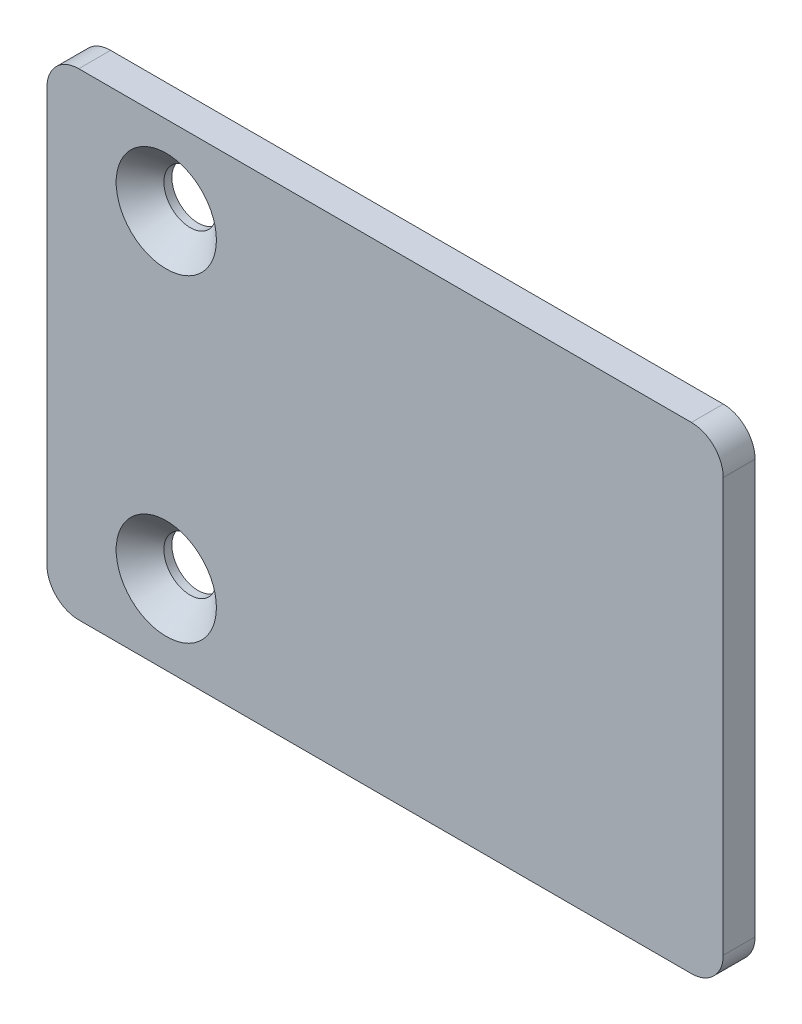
ISO-10303-21;
HEADER;
FILE_DESCRIPTION(('STEP AP214'),'2;1');
FILE_NAME('part.step','',(''),(''),'','','');
FILE_SCHEMA(('AUTOMOTIVE_DESIGN { 1 0 10303 214 1 1 1 1 }'));
ENDSEC;
DATA;
#1=APPLICATION_CONTEXT('core data for automotive mechanical design processes');
#2=APPLICATION_PROTOCOL_DEFINITION('international standard','automotive_design',2000,#1);
#3=PRODUCT_CONTEXT('',#1,'mechanical');
#4=PRODUCT('Part','Part','',(#3));
#5=PRODUCT_RELATED_PRODUCT_CATEGORY('part','',(#4));
#6=PRODUCT_DEFINITION_FORMATION('','',#4);
#7=PRODUCT_DEFINITION_CONTEXT('part definition',#1,'design');
#8=PRODUCT_DEFINITION('design','',#6,#7);
#9=PRODUCT_DEFINITION_SHAPE('','',#8);
#10=(LENGTH_UNIT() NAMED_UNIT(*) SI_UNIT(.MILLI.,.METRE.));
#11=(NAMED_UNIT(*) PLANE_ANGLE_UNIT() SI_UNIT($,.RADIAN.));
#12=(NAMED_UNIT(*) SI_UNIT($,.STERADIAN.) SOLID_ANGLE_UNIT());
#13=UNCERTAINTY_MEASURE_WITH_UNIT(LENGTH_MEASURE(1.E-05),#10,'distance_accuracy_value','');
#14=(GEOMETRIC_REPRESENTATION_CONTEXT(3) GLOBAL_UNCERTAINTY_ASSIGNED_CONTEXT((#13)) GLOBAL_UNIT_ASSIGNED_CONTEXT((#10,
#11,#12)) REPRESENTATION_CONTEXT('',''));
#15=CARTESIAN_POINT('',(0.,0.,0.));
#16=DIRECTION('',(0.,0.,1.));
#17=DIRECTION('',(1.,0.,0.));
#18=AXIS2_PLACEMENT_3D('',#15,#16,#17);
#19=CARTESIAN_POINT('',(0.,20.,3.99999999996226));
#20=DIRECTION('',(0.,0.,1.));
#21=DIRECTION('',(1.,0.,0.));
#22=AXIS2_PLACEMENT_3D('',#19,#20,#21);
#23=CONICAL_SURFACE('',#22,6.29999999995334,0.785398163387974);
#24=CARTESIAN_POINT('',(0.,20.,4.0000000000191));
#25=DIRECTION('',(0.,0.,1.));
#26=DIRECTION('',(1.,0.,0.));
#27=AXIS2_PLACEMENT_3D('',#24,#25,#26);
#28=CIRCLE('',#27,6.30000000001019);
#29=CARTESIAN_POINT('',(6.30000000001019,20.,4.0000000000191));
#30=VERTEX_POINT('',#29);
#31=EDGE_CURVE('E19',#30,#30,#28,.T.);
#32=ORIENTED_EDGE('',*,*,#31,.T.);
#33=EDGE_LOOP('',(#32));
#34=FACE_BOUND('',#33,.T.);
#35=CARTESIAN_POINT('',(0.,20.,1.));
#36=DIRECTION('',(0.,0.,1.));
#37=DIRECTION('',(1.,0.,0.));
#38=AXIS2_PLACEMENT_3D('',#35,#36,#37);
#39=CIRCLE('',#38,3.3);
#40=CARTESIAN_POINT('',(3.3,20.,1.));
#41=VERTEX_POINT('',#40);
#42=EDGE_CURVE('E123',#41,#41,#39,.F.);
#43=ORIENTED_EDGE('',*,*,#42,.T.);
#44=EDGE_LOOP('',(#43));
#45=FACE_BOUND('',#44,.T.);
#46=ADVANCED_FACE('F16',(#34,#45),#23,.F.);
#47=CARTESIAN_POINT('',(0.,-20.,3.99999999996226));
#48=DIRECTION('',(0.,0.,1.));
#49=DIRECTION('',(1.,0.,0.));
#50=AXIS2_PLACEMENT_3D('',#47,#48,#49);
#51=CONICAL_SURFACE('',#50,6.29999999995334,0.785398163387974);
#52=CARTESIAN_POINT('',(0.,-20.,4.0000000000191));
#53=DIRECTION('',(0.,0.,1.));
#54=DIRECTION('',(1.,0.,0.));
#55=AXIS2_PLACEMENT_3D('',#52,#53,#54);
#56=CIRCLE('',#55,6.30000000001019);
#57=CARTESIAN_POINT('',(6.30000000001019,-20.,4.0000000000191));
#58=VERTEX_POINT('',#57);
#59=EDGE_CURVE('E125',#58,#58,#56,.T.);
#60=ORIENTED_EDGE('',*,*,#59,.T.);
#61=EDGE_LOOP('',(#60));
#62=FACE_BOUND('',#61,.T.);
#63=CARTESIAN_POINT('',(0.,-20.,1.));
#64=DIRECTION('',(0.,0.,1.));
#65=DIRECTION('',(1.,0.,0.));
#66=AXIS2_PLACEMENT_3D('',#63,#64,#65);
#67=CIRCLE('',#66,3.3);
#68=CARTESIAN_POINT('',(3.3,-20.,1.));
#69=VERTEX_POINT('',#68);
#70=EDGE_CURVE('E117',#69,#69,#67,.F.);
#71=ORIENTED_EDGE('',*,*,#70,.T.);
#72=EDGE_LOOP('',(#71));
#73=FACE_BOUND('',#72,.T.);
#74=ADVANCED_FACE('F158',(#62,#73),#51,.F.);
#75=CARTESIAN_POINT('',(-15.,30.,4.));
#76=DIRECTION('',(0.,0.,-1.));
#77=DIRECTION('',(-1.,0.,0.));
#78=AXIS2_PLACEMENT_3D('',#75,#76,#77);
#79=PLANE('',#78);
#80=CARTESIAN_POINT('',(66.,-26.,4.));
#81=DIRECTION('',(0.,0.,-1.));
#82=DIRECTION('',(-1.,0.,0.));
#83=AXIS2_PLACEMENT_3D('',#80,#81,#82);
#84=CIRCLE('',#83,4.);
#85=CARTESIAN_POINT('',(70.,-26.,4.));
#86=VERTEX_POINT('',#85);
#87=CARTESIAN_POINT('',(66.,-30.,4.));
#88=VERTEX_POINT('',#87);
#89=EDGE_CURVE('E79',#86,#88,#84,.T.);
#90=ORIENTED_EDGE('',*,*,#89,.F.);
#91=DIRECTION('',(0.,1.,0.));
#92=VECTOR('',#91,1.);
#93=CARTESIAN_POINT('',(70.,30.,4.));
#94=LINE('',#93,#92);
#95=CARTESIAN_POINT('',(70.,26.,4.));
#96=VERTEX_POINT('',#95);
#97=EDGE_CURVE('E98',#86,#96,#94,.T.);
#98=ORIENTED_EDGE('',*,*,#97,.T.);
#99=CARTESIAN_POINT('',(66.,26.,4.));
#100=DIRECTION('',(0.,0.,-1.));
#101=DIRECTION('',(-1.,0.,0.));
#102=AXIS2_PLACEMENT_3D('',#99,#100,#101);
#103=CIRCLE('',#102,4.);
#104=CARTESIAN_POINT('',(66.,30.,4.));
#105=VERTEX_POINT('',#104);
#106=EDGE_CURVE('E114',#105,#96,#103,.T.);
#107=ORIENTED_EDGE('',*,*,#106,.F.);
#108=DIRECTION('',(1.,0.,0.));
#109=VECTOR('',#108,1.);
#110=CARTESIAN_POINT('',(-15.,30.,4.));
#111=LINE('',#110,#109);
#112=CARTESIAN_POINT('',(-11.,30.,4.));
#113=VERTEX_POINT('',#112);
#114=EDGE_CURVE('E111',#105,#113,#111,.F.);
#115=ORIENTED_EDGE('',*,*,#114,.T.);
#116=CARTESIAN_POINT('',(-11.,26.,4.));
#117=DIRECTION('',(0.,0.,-1.));
#118=DIRECTION('',(-1.,0.,0.));
#119=AXIS2_PLACEMENT_3D('',#116,#117,#118);
#120=CIRCLE('',#119,4.);
#121=CARTESIAN_POINT('',(-15.,26.,4.));
#122=VERTEX_POINT('',#121);
#123=EDGE_CURVE('E146',#122,#113,#120,.T.);
#124=ORIENTED_EDGE('',*,*,#123,.F.);
#125=DIRECTION('',(0.,1.,0.));
#126=VECTOR('',#125,1.);
#127=CARTESIAN_POINT('',(-15.,-30.,4.));
#128=LINE('',#127,#126);
#129=CARTESIAN_POINT('',(-15.,-26.,4.));
#130=VERTEX_POINT('',#129);
#131=EDGE_CURVE('E118',#122,#130,#128,.F.);
#132=ORIENTED_EDGE('',*,*,#131,.T.);
#133=CARTESIAN_POINT('',(-11.,-26.,4.));
#134=DIRECTION('',(0.,0.,-1.));
#135=DIRECTION('',(-1.,0.,0.));
#136=AXIS2_PLACEMENT_3D('',#133,#134,#135);
#137=CIRCLE('',#136,4.);
#138=CARTESIAN_POINT('',(-11.,-30.,4.));
#139=VERTEX_POINT('',#138);
#140=EDGE_CURVE('E86',#139,#130,#137,.T.);
#141=ORIENTED_EDGE('',*,*,#140,.F.);
#142=DIRECTION('',(-1.,0.,0.));
#143=VECTOR('',#142,1.);
#144=CARTESIAN_POINT('',(70.,-30.,4.));
#145=LINE('',#144,#143);
#146=EDGE_CURVE('E82',#139,#88,#145,.F.);
#147=ORIENTED_EDGE('',*,*,#146,.T.);
#148=EDGE_LOOP('',(#90,#98,#107,#115,#124,#132,#141,#147));
#149=FACE_BOUND('',#148,.T.);
#150=ORIENTED_EDGE('',*,*,#59,.F.);
#151=EDGE_LOOP('',(#150));
#152=FACE_BOUND('',#151,.T.);
#153=ORIENTED_EDGE('',*,*,#31,.F.);
#154=EDGE_LOOP('',(#153));
#155=FACE_BOUND('',#154,.T.);
#156=ADVANCED_FACE('F83',(#149,#152,#155),#79,.F.);
#157=CARTESIAN_POINT('',(0.,20.,4.));
#158=DIRECTION('',(0.,0.,1.));
#159=DIRECTION('',(1.,0.,0.));
#160=AXIS2_PLACEMENT_3D('',#157,#158,#159);
#161=CYLINDRICAL_SURFACE('',#160,3.3);
#162=ORIENTED_EDGE('',*,*,#42,.F.);
#163=EDGE_LOOP('',(#162));
#164=FACE_BOUND('',#163,.T.);
#165=CARTESIAN_POINT('',(0.,20.,0.));
#166=DIRECTION('',(0.,0.,1.));
#167=DIRECTION('',(1.,0.,0.));
#168=AXIS2_PLACEMENT_3D('',#165,#166,#167);
#169=CIRCLE('',#168,3.3);
#170=CARTESIAN_POINT('',(3.3,20.,0.));
#171=VERTEX_POINT('',#170);
#172=EDGE_CURVE('E140',#171,#171,#169,.T.);
#173=ORIENTED_EDGE('',*,*,#172,.F.);
#174=EDGE_LOOP('',(#173));
#175=FACE_BOUND('',#174,.T.);
#176=ADVANCED_FACE('F157',(#164,#175),#161,.F.);
#177=CARTESIAN_POINT('',(0.,-20.,4.));
#178=DIRECTION('',(0.,0.,1.));
#179=DIRECTION('',(1.,0.,0.));
#180=AXIS2_PLACEMENT_3D('',#177,#178,#179);
#181=CYLINDRICAL_SURFACE('',#180,3.3);
#182=ORIENTED_EDGE('',*,*,#70,.F.);
#183=EDGE_LOOP('',(#182));
#184=FACE_BOUND('',#183,.T.);
#185=CARTESIAN_POINT('',(0.,-20.,0.));
#186=DIRECTION('',(0.,0.,1.));
#187=DIRECTION('',(1.,0.,0.));
#188=AXIS2_PLACEMENT_3D('',#185,#186,#187);
#189=CIRCLE('',#188,3.3);
#190=CARTESIAN_POINT('',(3.3,-20.,0.));
#191=VERTEX_POINT('',#190);
#192=EDGE_CURVE('E137',#191,#191,#189,.T.);
#193=ORIENTED_EDGE('',*,*,#192,.F.);
#194=EDGE_LOOP('',(#193));
#195=FACE_BOUND('',#194,.T.);
#196=ADVANCED_FACE('F165',(#184,#195),#181,.F.);
#197=CARTESIAN_POINT('',(70.,30.,4.));
#198=DIRECTION('',(-1.,0.,0.));
#199=DIRECTION('',(0.,0.,1.));
#200=AXIS2_PLACEMENT_3D('',#197,#198,#199);
#201=PLANE('',#200);
#202=DIRECTION('',(0.,0.,-1.));
#203=VECTOR('',#202,1.);
#204=CARTESIAN_POINT('',(70.,-26.,4.));
#205=LINE('',#204,#203);
#206=CARTESIAN_POINT('',(70.,-26.,0.));
#207=VERTEX_POINT('',#206);
#208=EDGE_CURVE('E91',#207,#86,#205,.F.);
#209=ORIENTED_EDGE('',*,*,#208,.F.);
#210=DIRECTION('',(0.,1.,0.));
#211=VECTOR('',#210,1.);
#212=CARTESIAN_POINT('',(70.,30.,0.));
#213=LINE('',#212,#211);
#214=CARTESIAN_POINT('',(70.,26.,0.));
#215=VERTEX_POINT('',#214);
#216=EDGE_CURVE('E136',#215,#207,#213,.F.);
#217=ORIENTED_EDGE('',*,*,#216,.F.);
#218=DIRECTION('',(0.,0.,-1.));
#219=VECTOR('',#218,1.);
#220=CARTESIAN_POINT('',(70.,26.,4.));
#221=LINE('',#220,#219);
#222=EDGE_CURVE('E145',#96,#215,#221,.T.);
#223=ORIENTED_EDGE('',*,*,#222,.F.);
#224=ORIENTED_EDGE('',*,*,#97,.F.);
#225=EDGE_LOOP('',(#209,#217,#223,#224));
#226=FACE_BOUND('',#225,.T.);
#227=ADVANCED_FACE('F200',(#226),#201,.F.);
#228=CARTESIAN_POINT('',(66.,-26.,4.));
#229=DIRECTION('',(0.,0.,-1.));
#230=DIRECTION('',(-1.,0.,0.));
#231=AXIS2_PLACEMENT_3D('',#228,#229,#230);
#232=CYLINDRICAL_SURFACE('',#231,4.);
#233=CARTESIAN_POINT('',(66.,-26.,0.));
#234=DIRECTION('',(0.,0.,-1.));
#235=DIRECTION('',(-1.,0.,0.));
#236=AXIS2_PLACEMENT_3D('',#233,#234,#235);
#237=CIRCLE('',#236,4.);
#238=CARTESIAN_POINT('',(66.,-30.,0.));
#239=VERTEX_POINT('',#238);
#240=EDGE_CURVE('E134',#207,#239,#237,.T.);
#241=ORIENTED_EDGE('',*,*,#240,.F.);
#242=ORIENTED_EDGE('',*,*,#208,.T.);
#243=ORIENTED_EDGE('',*,*,#89,.T.);
#244=DIRECTION('',(0.,0.,1.));
#245=VECTOR('',#244,1.);
#246=CARTESIAN_POINT('',(66.,-30.,4.));
#247=LINE('',#246,#245);
#248=EDGE_CURVE('E90',#88,#239,#247,.F.);
#249=ORIENTED_EDGE('',*,*,#248,.T.);
#250=EDGE_LOOP('',(#241,#242,#243,#249));
#251=FACE_BOUND('',#250,.T.);
#252=ADVANCED_FACE('F96',(#251),#232,.T.);
#253=CARTESIAN_POINT('',(70.,-30.,4.));
#254=DIRECTION('',(0.,1.,0.));
#255=DIRECTION('',(-1.,0.,0.));
#256=AXIS2_PLACEMENT_3D('',#253,#254,#255);
#257=PLANE('',#256);
#258=ORIENTED_EDGE('',*,*,#248,.F.);
#259=ORIENTED_EDGE('',*,*,#146,.F.);
#260=DIRECTION('',(0.,0.,-1.));
#261=VECTOR('',#260,1.);
#262=CARTESIAN_POINT('',(-11.,-30.,4.));
#263=LINE('',#262,#261);
#264=CARTESIAN_POINT('',(-11.,-30.,0.));
#265=VERTEX_POINT('',#264);
#266=EDGE_CURVE('E105',#265,#139,#263,.F.);
#267=ORIENTED_EDGE('',*,*,#266,.F.);
#268=DIRECTION('',(-1.,0.,0.));
#269=VECTOR('',#268,1.);
#270=CARTESIAN_POINT('',(-15.,-30.,0.));
#271=LINE('',#270,#269);
#272=EDGE_CURVE('E102',#239,#265,#271,.T.);
#273=ORIENTED_EDGE('',*,*,#272,.F.);
#274=EDGE_LOOP('',(#258,#259,#267,#273));
#275=FACE_BOUND('',#274,.T.);
#276=ADVANCED_FACE('F100',(#275),#257,.F.);
#277=CARTESIAN_POINT('',(-11.,-26.,4.));
#278=DIRECTION('',(0.,0.,-1.));
#279=DIRECTION('',(-1.,0.,0.));
#280=AXIS2_PLACEMENT_3D('',#277,#278,#279);
#281=CYLINDRICAL_SURFACE('',#280,4.);
#282=CARTESIAN_POINT('',(-11.,-26.,0.));
#283=DIRECTION('',(0.,0.,-1.));
#284=DIRECTION('',(-1.,0.,0.));
#285=AXIS2_PLACEMENT_3D('',#282,#283,#284);
#286=CIRCLE('',#285,4.);
#287=CARTESIAN_POINT('',(-15.,-26.,0.));
#288=VERTEX_POINT('',#287);
#289=EDGE_CURVE('E131',#265,#288,#286,.T.);
#290=ORIENTED_EDGE('',*,*,#289,.F.);
#291=ORIENTED_EDGE('',*,*,#266,.T.);
#292=ORIENTED_EDGE('',*,*,#140,.T.);
#293=DIRECTION('',(0.,0.,-1.));
#294=VECTOR('',#293,1.);
#295=CARTESIAN_POINT('',(-15.,-26.,4.));
#296=LINE('',#295,#294);
#297=EDGE_CURVE('E119',#130,#288,#296,.T.);
#298=ORIENTED_EDGE('',*,*,#297,.T.);
#299=EDGE_LOOP('',(#290,#291,#292,#298));
#300=FACE_BOUND('',#299,.T.);
#301=ADVANCED_FACE('F191',(#300),#281,.T.);
#302=CARTESIAN_POINT('',(-15.,-30.,4.));
#303=DIRECTION('',(1.,0.,0.));
#304=DIRECTION('',(0.,0.,-1.));
#305=AXIS2_PLACEMENT_3D('',#302,#303,#304);
#306=PLANE('',#305);
#307=ORIENTED_EDGE('',*,*,#297,.F.);
#308=ORIENTED_EDGE('',*,*,#131,.F.);
#309=DIRECTION('',(0.,0.,-1.));
#310=VECTOR('',#309,1.);
#311=CARTESIAN_POINT('',(-15.,26.,4.));
#312=LINE('',#311,#310);
#313=CARTESIAN_POINT('',(-15.,26.,0.));
#314=VERTEX_POINT('',#313);
#315=EDGE_CURVE('E147',#314,#122,#312,.F.);
#316=ORIENTED_EDGE('',*,*,#315,.F.);
#317=DIRECTION('',(0.,1.,0.));
#318=VECTOR('',#317,1.);
#319=CARTESIAN_POINT('',(-15.,30.,0.));
#320=LINE('',#319,#318);
#321=EDGE_CURVE('E130',#288,#314,#320,.T.);
#322=ORIENTED_EDGE('',*,*,#321,.F.);
#323=EDGE_LOOP('',(#307,#308,#316,#322));
#324=FACE_BOUND('',#323,.T.);
#325=ADVANCED_FACE('F187',(#324),#306,.F.);
#326=CARTESIAN_POINT('',(-11.,26.,4.));
#327=DIRECTION('',(0.,0.,-1.));
#328=DIRECTION('',(-1.,0.,0.));
#329=AXIS2_PLACEMENT_3D('',#326,#327,#328);
#330=CYLINDRICAL_SURFACE('',#329,4.);
#331=CARTESIAN_POINT('',(-11.,26.,0.));
#332=DIRECTION('',(0.,0.,-1.));
#333=DIRECTION('',(-1.,0.,0.));
#334=AXIS2_PLACEMENT_3D('',#331,#332,#333);
#335=CIRCLE('',#334,4.);
#336=CARTESIAN_POINT('',(-11.,30.,0.));
#337=VERTEX_POINT('',#336);
#338=EDGE_CURVE('E127',#314,#337,#335,.T.);
#339=ORIENTED_EDGE('',*,*,#338,.F.);
#340=ORIENTED_EDGE('',*,*,#315,.T.);
#341=ORIENTED_EDGE('',*,*,#123,.T.);
#342=DIRECTION('',(0.,0.,1.));
#343=VECTOR('',#342,1.);
#344=CARTESIAN_POINT('',(-11.,30.,4.));
#345=LINE('',#344,#343);
#346=EDGE_CURVE('E115',#113,#337,#345,.F.);
#347=ORIENTED_EDGE('',*,*,#346,.T.);
#348=EDGE_LOOP('',(#339,#340,#341,#347));
#349=FACE_BOUND('',#348,.T.);
#350=ADVANCED_FACE('F184',(#349),#330,.T.);
#351=CARTESIAN_POINT('',(-15.,30.,4.));
#352=DIRECTION('',(0.,-1.,0.));
#353=DIRECTION('',(1.,0.,0.));
#354=AXIS2_PLACEMENT_3D('',#351,#352,#353);
#355=PLANE('',#354);
#356=DIRECTION('',(0.,0.,-1.));
#357=VECTOR('',#356,1.);
#358=CARTESIAN_POINT('',(66.,30.,4.));
#359=LINE('',#358,#357);
#360=CARTESIAN_POINT('',(66.,30.,0.));
#361=VERTEX_POINT('',#360);
#362=EDGE_CURVE('E34',#361,#105,#359,.F.);
#363=ORIENTED_EDGE('',*,*,#362,.F.);
#364=DIRECTION('',(-1.,0.,0.));
#365=VECTOR('',#364,1.);
#366=CARTESIAN_POINT('',(-15.,30.,0.));
#367=LINE('',#366,#365);
#368=EDGE_CURVE('E25',#337,#361,#367,.F.);
#369=ORIENTED_EDGE('',*,*,#368,.F.);
#370=ORIENTED_EDGE('',*,*,#346,.F.);
#371=ORIENTED_EDGE('',*,*,#114,.F.);
#372=EDGE_LOOP('',(#363,#369,#370,#371));
#373=FACE_BOUND('',#372,.T.);
#374=ADVANCED_FACE('F176',(#373),#355,.F.);
#375=CARTESIAN_POINT('',(66.,26.,4.));
#376=DIRECTION('',(0.,0.,-1.));
#377=DIRECTION('',(-1.,0.,0.));
#378=AXIS2_PLACEMENT_3D('',#375,#376,#377);
#379=CYLINDRICAL_SURFACE('',#378,4.);
#380=CARTESIAN_POINT('',(66.,26.,0.));
#381=DIRECTION('',(0.,0.,-1.));
#382=DIRECTION('',(-1.,0.,0.));
#383=AXIS2_PLACEMENT_3D('',#380,#381,#382);
#384=CIRCLE('',#383,4.);
#385=EDGE_CURVE('E11',#361,#215,#384,.T.);
#386=ORIENTED_EDGE('',*,*,#385,.F.);
#387=ORIENTED_EDGE('',*,*,#362,.T.);
#388=ORIENTED_EDGE('',*,*,#106,.T.);
#389=ORIENTED_EDGE('',*,*,#222,.T.);
#390=EDGE_LOOP('',(#386,#387,#388,#389));
#391=FACE_BOUND('',#390,.T.);
#392=ADVANCED_FACE('F170',(#391),#379,.T.);
#393=CARTESIAN_POINT('',(-15.,30.,0.));
#394=DIRECTION('',(0.,0.,-1.));
#395=DIRECTION('',(-1.,0.,0.));
#396=AXIS2_PLACEMENT_3D('',#393,#394,#395);
#397=PLANE('',#396);
#398=ORIENTED_EDGE('',*,*,#368,.T.);
#399=ORIENTED_EDGE('',*,*,#385,.T.);
#400=ORIENTED_EDGE('',*,*,#216,.T.);
#401=ORIENTED_EDGE('',*,*,#240,.T.);
#402=ORIENTED_EDGE('',*,*,#272,.T.);
#403=ORIENTED_EDGE('',*,*,#289,.T.);
#404=ORIENTED_EDGE('',*,*,#321,.T.);
#405=ORIENTED_EDGE('',*,*,#338,.T.);
#406=EDGE_LOOP('',(#398,#399,#400,#401,#402,#403,#404,#405));
#407=FACE_BOUND('',#406,.T.);
#408=ORIENTED_EDGE('',*,*,#192,.T.);
#409=EDGE_LOOP('',(#408));
#410=FACE_BOUND('',#409,.T.);
#411=ORIENTED_EDGE('',*,*,#172,.T.);
#412=EDGE_LOOP('',(#411));
#413=FACE_BOUND('',#412,.T.);
#414=ADVANCED_FACE('F168',(#407,#410,#413),#397,.T.);
#415=CLOSED_SHELL('',(#46,#74,#156,#176,#196,#227,#252,#276,#301,#325,#350,#374,#392,#414));
#416=MANIFOLD_SOLID_BREP('B1',#415);
#417=ADVANCED_BREP_SHAPE_REPRESENTATION('',(#18,#416),#14);
#418=SHAPE_DEFINITION_REPRESENTATION(#9,#417);
ENDSEC;
END-ISO-10303-21;
